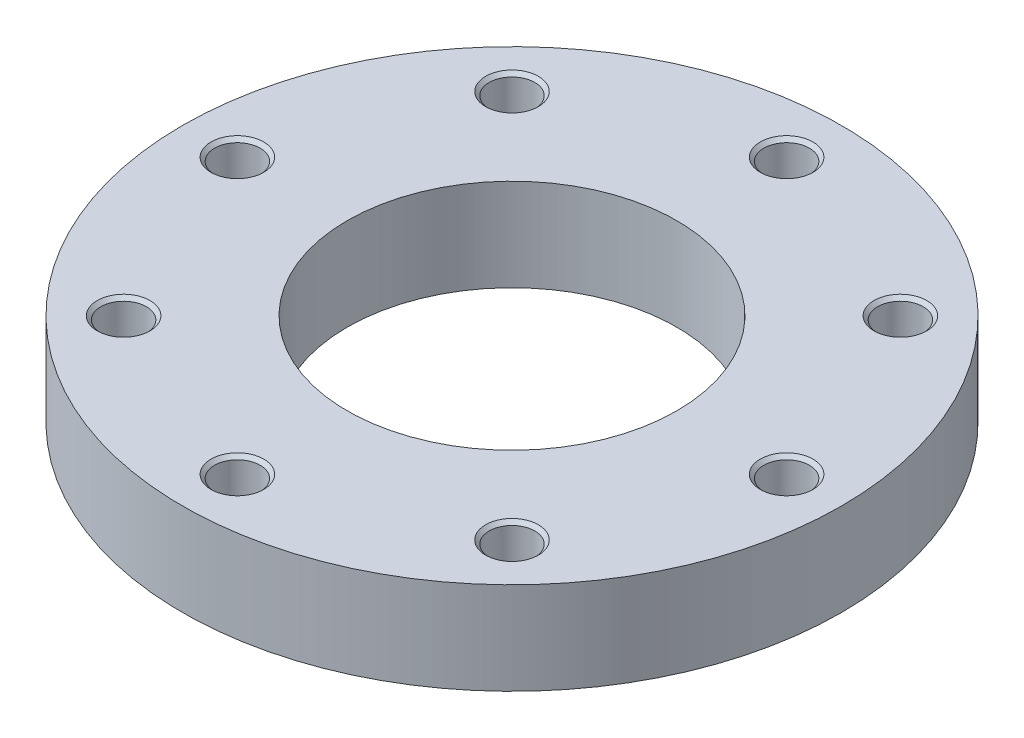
ISO-10303-21;
HEADER;
FILE_DESCRIPTION(('STEP AP214'),'2;1');
FILE_NAME('part.step','',(''),(''),'','','');
FILE_SCHEMA(('AUTOMOTIVE_DESIGN { 1 0 10303 214 1 1 1 1 }'));
ENDSEC;
DATA;
#1=APPLICATION_CONTEXT('core data for automotive mechanical design processes');
#2=APPLICATION_PROTOCOL_DEFINITION('international standard','automotive_design',2000,#1);
#3=PRODUCT_CONTEXT('',#1,'mechanical');
#4=PRODUCT('Part','Part','',(#3));
#5=PRODUCT_RELATED_PRODUCT_CATEGORY('part','',(#4));
#6=PRODUCT_DEFINITION_FORMATION('','',#4);
#7=PRODUCT_DEFINITION_CONTEXT('part definition',#1,'design');
#8=PRODUCT_DEFINITION('design','',#6,#7);
#9=PRODUCT_DEFINITION_SHAPE('','',#8);
#10=(LENGTH_UNIT() NAMED_UNIT(*) SI_UNIT(.MILLI.,.METRE.));
#11=(NAMED_UNIT(*) PLANE_ANGLE_UNIT() SI_UNIT($,.RADIAN.));
#12=(NAMED_UNIT(*) SI_UNIT($,.STERADIAN.) SOLID_ANGLE_UNIT());
#13=UNCERTAINTY_MEASURE_WITH_UNIT(LENGTH_MEASURE(1.E-05),#10,'distance_accuracy_value','');
#14=(GEOMETRIC_REPRESENTATION_CONTEXT(3) GLOBAL_UNCERTAINTY_ASSIGNED_CONTEXT((#13)) GLOBAL_UNIT_ASSIGNED_CONTEXT((#10,
#11,#12)) REPRESENTATION_CONTEXT('',''));
#15=CARTESIAN_POINT('',(0.,0.,0.));
#16=DIRECTION('',(0.,0.,1.));
#17=DIRECTION('',(1.,0.,0.));
#18=AXIS2_PLACEMENT_3D('',#15,#16,#17);
#19=CARTESIAN_POINT('',(0.,21.,0.));
#20=DIRECTION('',(0.,-1.,0.));
#21=DIRECTION('',(1.,0.,0.));
#22=AXIS2_PLACEMENT_3D('',#19,#20,#21);
#23=CYLINDRICAL_SURFACE('',#22,150.);
#24=CARTESIAN_POINT('',(0.,0.,0.));
#25=DIRECTION('',(0.,1.,0.));
#26=DIRECTION('',(1.,0.,0.));
#27=AXIS2_PLACEMENT_3D('',#24,#25,#26);
#28=CIRCLE('',#27,150.);
#29=CARTESIAN_POINT('',(150.,0.,0.));
#30=VERTEX_POINT('',#29);
#31=EDGE_CURVE('E9',#30,#30,#28,.T.);
#32=ORIENTED_EDGE('',*,*,#31,.T.);
#33=EDGE_LOOP('',(#32));
#34=FACE_BOUND('',#33,.T.);
#35=CARTESIAN_POINT('',(0.,42.,0.));
#36=DIRECTION('',(0.,1.,0.));
#37=DIRECTION('',(1.,0.,0.));
#38=AXIS2_PLACEMENT_3D('',#35,#36,#37);
#39=CIRCLE('',#38,150.);
#40=CARTESIAN_POINT('',(150.,42.,0.));
#41=VERTEX_POINT('',#40);
#42=EDGE_CURVE('E216',#41,#41,#39,.T.);
#43=ORIENTED_EDGE('',*,*,#42,.F.);
#44=EDGE_LOOP('',(#43));
#45=FACE_BOUND('',#44,.T.);
#46=ADVANCED_FACE('F15',(#34,#45),#23,.T.);
#47=CARTESIAN_POINT('',(112.5,0.,0.));
#48=DIRECTION('',(0.,-1.,0.));
#49=DIRECTION('',(-1.,0.,0.));
#50=AXIS2_PLACEMENT_3D('',#47,#48,#49);
#51=PLANE('',#50);
#52=CARTESIAN_POINT('',(0.,0.,0.));
#53=DIRECTION('',(0.,1.,0.));
#54=DIRECTION('',(1.,0.,0.));
#55=AXIS2_PLACEMENT_3D('',#52,#53,#54);
#56=CIRCLE('',#55,75.);
#57=CARTESIAN_POINT('',(75.,0.,0.));
#58=VERTEX_POINT('',#57);
#59=EDGE_CURVE('E18',#58,#58,#56,.T.);
#60=ORIENTED_EDGE('',*,*,#59,.T.);
#61=EDGE_LOOP('',(#60));
#62=FACE_BOUND('',#61,.T.);
#63=ORIENTED_EDGE('',*,*,#31,.F.);
#64=EDGE_LOOP('',(#63));
#65=FACE_BOUND('',#64,.T.);
#66=ADVANCED_FACE('F221',(#62,#65),#51,.T.);
#67=CARTESIAN_POINT('',(0.,21.,0.));
#68=DIRECTION('',(0.,-1.,0.));
#69=DIRECTION('',(1.,0.,0.));
#70=AXIS2_PLACEMENT_3D('',#67,#68,#69);
#71=CYLINDRICAL_SURFACE('',#70,75.);
#72=CARTESIAN_POINT('',(0.,42.,0.));
#73=DIRECTION('',(0.,1.,0.));
#74=DIRECTION('',(1.,0.,0.));
#75=AXIS2_PLACEMENT_3D('',#72,#73,#74);
#76=CIRCLE('',#75,75.);
#77=CARTESIAN_POINT('',(75.,42.,0.));
#78=VERTEX_POINT('',#77);
#79=EDGE_CURVE('E105',#78,#78,#76,.T.);
#80=ORIENTED_EDGE('',*,*,#79,.T.);
#81=EDGE_LOOP('',(#80));
#82=FACE_BOUND('',#81,.T.);
#83=ORIENTED_EDGE('',*,*,#59,.F.);
#84=EDGE_LOOP('',(#83));
#85=FACE_BOUND('',#84,.T.);
#86=ADVANCED_FACE('F224',(#82,#85),#71,.F.);
#87=CARTESIAN_POINT('',(112.5,42.,0.));
#88=DIRECTION('',(0.,1.,0.));
#89=DIRECTION('',(1.,0.,0.));
#90=AXIS2_PLACEMENT_3D('',#87,#88,#89);
#91=PLANE('',#90);
#92=ORIENTED_EDGE('',*,*,#42,.T.);
#93=EDGE_LOOP('',(#92));
#94=FACE_BOUND('',#93,.T.);
#95=ORIENTED_EDGE('',*,*,#79,.F.);
#96=EDGE_LOOP('',(#95));
#97=FACE_BOUND('',#96,.T.);
#98=CARTESIAN_POINT('',(125.,42.,0.));
#99=DIRECTION('',(0.,-1.,0.));
#100=DIRECTION('',(1.,0.,0.));
#101=AXIS2_PLACEMENT_3D('',#98,#99,#100);
#102=CIRCLE('',#101,12.);
#103=CARTESIAN_POINT('',(137.,42.,0.));
#104=VERTEX_POINT('',#103);
#105=EDGE_CURVE('E211',#104,#104,#102,.T.);
#106=ORIENTED_EDGE('',*,*,#105,.T.);
#107=EDGE_LOOP('',(#106));
#108=FACE_BOUND('',#107,.T.);
#109=CARTESIAN_POINT('',(88.3883476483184,42.,-88.3883476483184));
#110=DIRECTION('',(0.,-1.,0.));
#111=DIRECTION('',(0.707106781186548,0.,-0.707106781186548));
#112=AXIS2_PLACEMENT_3D('',#109,#110,#111);
#113=CIRCLE('',#112,12.);
#114=CARTESIAN_POINT('',(96.873629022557,42.,-96.873629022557));
#115=VERTEX_POINT('',#114);
#116=EDGE_CURVE('E197',#115,#115,#113,.T.);
#117=ORIENTED_EDGE('',*,*,#116,.T.);
#118=EDGE_LOOP('',(#117));
#119=FACE_BOUND('',#118,.T.);
#120=CARTESIAN_POINT('',(0.,42.,-125.));
#121=DIRECTION('',(0.,-1.,0.));
#122=DIRECTION('',(0.,0.,-1.));
#123=AXIS2_PLACEMENT_3D('',#120,#121,#122);
#124=CIRCLE('',#123,12.);
#125=CARTESIAN_POINT('',(0.,42.,-137.));
#126=VERTEX_POINT('',#125);
#127=EDGE_CURVE('E185',#126,#126,#124,.T.);
#128=ORIENTED_EDGE('',*,*,#127,.T.);
#129=EDGE_LOOP('',(#128));
#130=FACE_BOUND('',#129,.T.);
#131=CARTESIAN_POINT('',(-88.3883476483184,42.,-88.3883476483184));
#132=DIRECTION('',(0.,-1.,0.));
#133=DIRECTION('',(-0.707106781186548,0.,-0.707106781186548));
#134=AXIS2_PLACEMENT_3D('',#131,#132,#133);
#135=CIRCLE('',#134,12.);
#136=CARTESIAN_POINT('',(-96.873629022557,42.,-96.873629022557));
#137=VERTEX_POINT('',#136);
#138=EDGE_CURVE('E178',#137,#137,#135,.T.);
#139=ORIENTED_EDGE('',*,*,#138,.T.);
#140=EDGE_LOOP('',(#139));
#141=FACE_BOUND('',#140,.T.);
#142=CARTESIAN_POINT('',(-125.,42.,0.));
#143=DIRECTION('',(0.,-1.,0.));
#144=DIRECTION('',(-1.,0.,0.));
#145=AXIS2_PLACEMENT_3D('',#142,#143,#144);
#146=CIRCLE('',#145,12.);
#147=CARTESIAN_POINT('',(-137.,42.,0.));
#148=VERTEX_POINT('',#147);
#149=EDGE_CURVE('E758',#148,#148,#146,.T.);
#150=ORIENTED_EDGE('',*,*,#149,.T.);
#151=EDGE_LOOP('',(#150));
#152=FACE_BOUND('',#151,.T.);
#153=CARTESIAN_POINT('',(-88.3883476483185,42.,88.3883476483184));
#154=DIRECTION('',(0.,-1.,0.));
#155=DIRECTION('',(-0.707106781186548,0.,0.707106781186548));
#156=AXIS2_PLACEMENT_3D('',#153,#154,#155);
#157=CIRCLE('',#156,12.);
#158=CARTESIAN_POINT('',(-96.873629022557,42.,96.873629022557));
#159=VERTEX_POINT('',#158);
#160=EDGE_CURVE('E773',#159,#159,#157,.T.);
#161=ORIENTED_EDGE('',*,*,#160,.T.);
#162=EDGE_LOOP('',(#161));
#163=FACE_BOUND('',#162,.T.);
#164=CARTESIAN_POINT('',(0.,42.,125.));
#165=DIRECTION('',(0.,-1.,0.));
#166=DIRECTION('',(0.,0.,1.));
#167=AXIS2_PLACEMENT_3D('',#164,#165,#166);
#168=CIRCLE('',#167,12.);
#169=CARTESIAN_POINT('',(0.,42.,137.));
#170=VERTEX_POINT('',#169);
#171=EDGE_CURVE('E765',#170,#170,#168,.T.);
#172=ORIENTED_EDGE('',*,*,#171,.T.);
#173=EDGE_LOOP('',(#172));
#174=FACE_BOUND('',#173,.T.);
#175=CARTESIAN_POINT('',(88.3883476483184,42.,88.3883476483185));
#176=DIRECTION('',(0.,-1.,0.));
#177=DIRECTION('',(0.707106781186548,0.,0.707106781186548));
#178=AXIS2_PLACEMENT_3D('',#175,#176,#177);
#179=CIRCLE('',#178,12.);
#180=CARTESIAN_POINT('',(96.873629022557,42.,96.873629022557));
#181=VERTEX_POINT('',#180);
#182=EDGE_CURVE('E745',#181,#181,#179,.T.);
#183=ORIENTED_EDGE('',*,*,#182,.T.);
#184=EDGE_LOOP('',(#183));
#185=FACE_BOUND('',#184,.T.);
#186=ADVANCED_FACE('F226',(#94,#97,#108,#119,#130,#141,#152,#163,#174,#185),#91,.T.);
#187=CARTESIAN_POINT('',(125.,6.00463463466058,0.));
#188=DIRECTION('',(0.,1.,0.));
#189=DIRECTION('',(1.,0.,0.));
#190=AXIS2_PLACEMENT_3D('',#187,#188,#189);
#191=CONICAL_SURFACE('',#190,5.188125,1.0471975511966);
#192=CARTESIAN_POINT('',(125.,9.,0.));
#193=DIRECTION('',(0.,-1.,0.));
#194=DIRECTION('',(1.,0.,0.));
#195=AXIS2_PLACEMENT_3D('',#192,#193,#194);
#196=CIRCLE('',#195,10.37625);
#197=CARTESIAN_POINT('',(135.37625,9.,0.));
#198=VERTEX_POINT('',#197);
#199=EDGE_CURVE('E100',#198,#198,#196,.T.);
#200=ORIENTED_EDGE('',*,*,#199,.F.);
#201=EDGE_LOOP('',(#200));
#202=FACE_BOUND('',#201,.T.);
#203=CARTESIAN_POINT('',(125.,3.00926926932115,0.));
#204=VERTEX_POINT('',#203);
#205=VERTEX_LOOP('',#204);
#206=FACE_BOUND('',#205,.T.);
#207=ADVANCED_FACE('F233',(#202,#206),#191,.F.);
#208=CARTESIAN_POINT('',(125.,12.688125,0.));
#209=DIRECTION('',(0.,1.,0.));
#210=DIRECTION('',(1.,0.,0.));
#211=AXIS2_PLACEMENT_3D('',#208,#209,#210);
#212=CYLINDRICAL_SURFACE('',#211,10.37625);
#213=CARTESIAN_POINT('',(125.,16.37625,0.));
#214=DIRECTION('',(0.,-1.,0.));
#215=DIRECTION('',(1.,0.,0.));
#216=AXIS2_PLACEMENT_3D('',#213,#214,#215);
#217=CIRCLE('',#216,10.37625);
#218=CARTESIAN_POINT('',(135.37625,16.37625,0.));
#219=VERTEX_POINT('',#218);
#220=EDGE_CURVE('E95',#219,#219,#217,.T.);
#221=ORIENTED_EDGE('',*,*,#220,.F.);
#222=EDGE_LOOP('',(#221));
#223=FACE_BOUND('',#222,.T.);
#224=ORIENTED_EDGE('',*,*,#199,.T.);
#225=EDGE_LOOP('',(#224));
#226=FACE_BOUND('',#225,.T.);
#227=ADVANCED_FACE('F269',(#223,#226),#212,.F.);
#228=CARTESIAN_POINT('',(125.,17.188125,0.));
#229=DIRECTION('',(0.,1.,0.));
#230=DIRECTION('',(1.,0.,0.));
#231=AXIS2_PLACEMENT_3D('',#228,#229,#230);
#232=CONICAL_SURFACE('',#231,11.188125,0.785398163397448);
#233=CARTESIAN_POINT('',(125.,18.,0.));
#234=DIRECTION('',(0.,-1.,0.));
#235=DIRECTION('',(1.,0.,0.));
#236=AXIS2_PLACEMENT_3D('',#233,#234,#235);
#237=CIRCLE('',#236,12.);
#238=CARTESIAN_POINT('',(137.,18.,0.));
#239=VERTEX_POINT('',#238);
#240=EDGE_CURVE('E214',#239,#239,#237,.T.);
#241=ORIENTED_EDGE('',*,*,#240,.F.);
#242=EDGE_LOOP('',(#241));
#243=FACE_BOUND('',#242,.T.);
#244=ORIENTED_EDGE('',*,*,#220,.T.);
#245=EDGE_LOOP('',(#244));
#246=FACE_BOUND('',#245,.T.);
#247=ADVANCED_FACE('F279',(#243,#246),#232,.F.);
#248=CARTESIAN_POINT('',(136.188125,18.,0.));
#249=DIRECTION('',(0.,1.,0.));
#250=DIRECTION('',(-1.,0.,0.));
#251=AXIS2_PLACEMENT_3D('',#248,#249,#250);
#252=PLANE('',#251);
#253=CARTESIAN_POINT('',(125.,18.,0.));
#254=DIRECTION('',(0.,-1.,0.));
#255=DIRECTION('',(1.,0.,0.));
#256=AXIS2_PLACEMENT_3D('',#253,#254,#255);
#257=CIRCLE('',#256,10.37625);
#258=CARTESIAN_POINT('',(135.37625,18.,0.));
#259=VERTEX_POINT('',#258);
#260=EDGE_CURVE('E212',#259,#259,#257,.T.);
#261=ORIENTED_EDGE('',*,*,#260,.F.);
#262=EDGE_LOOP('',(#261));
#263=FACE_BOUND('',#262,.T.);
#264=ORIENTED_EDGE('',*,*,#240,.T.);
#265=EDGE_LOOP('',(#264));
#266=FACE_BOUND('',#265,.T.);
#267=ADVANCED_FACE('F289',(#263,#266),#252,.F.);
#268=CARTESIAN_POINT('',(125.,29.188125,0.));
#269=DIRECTION('',(0.,1.,0.));
#270=DIRECTION('',(1.,0.,0.));
#271=AXIS2_PLACEMENT_3D('',#268,#269,#270);
#272=CYLINDRICAL_SURFACE('',#271,10.37625);
#273=CARTESIAN_POINT('',(125.,40.37625,0.));
#274=DIRECTION('',(0.,-1.,0.));
#275=DIRECTION('',(1.,0.,0.));
#276=AXIS2_PLACEMENT_3D('',#273,#274,#275);
#277=CIRCLE('',#276,10.37625);
#278=CARTESIAN_POINT('',(135.37625,40.37625,0.));
#279=VERTEX_POINT('',#278);
#280=EDGE_CURVE('E209',#279,#279,#277,.T.);
#281=ORIENTED_EDGE('',*,*,#280,.F.);
#282=EDGE_LOOP('',(#281));
#283=FACE_BOUND('',#282,.T.);
#284=ORIENTED_EDGE('',*,*,#260,.T.);
#285=EDGE_LOOP('',(#284));
#286=FACE_BOUND('',#285,.T.);
#287=ADVANCED_FACE('F299',(#283,#286),#272,.F.);
#288=CARTESIAN_POINT('',(125.,41.188125,0.));
#289=DIRECTION('',(0.,1.,0.));
#290=DIRECTION('',(1.,0.,0.));
#291=AXIS2_PLACEMENT_3D('',#288,#289,#290);
#292=CONICAL_SURFACE('',#291,11.188125,0.785398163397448);
#293=ORIENTED_EDGE('',*,*,#105,.F.);
#294=EDGE_LOOP('',(#293));
#295=FACE_BOUND('',#294,.T.);
#296=ORIENTED_EDGE('',*,*,#280,.T.);
#297=EDGE_LOOP('',(#296));
#298=FACE_BOUND('',#297,.T.);
#299=ADVANCED_FACE('F309',(#295,#298),#292,.F.);
#300=CARTESIAN_POINT('',(88.3883476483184,6.00463463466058,-88.3883476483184));
#301=DIRECTION('',(0.,1.,0.));
#302=DIRECTION('',(0.707106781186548,0.,-0.707106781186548));
#303=AXIS2_PLACEMENT_3D('',#300,#301,#302);
#304=CONICAL_SURFACE('',#303,5.188125,1.0471975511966);
#305=CARTESIAN_POINT('',(88.3883476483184,9.,-88.3883476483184));
#306=DIRECTION('',(0.,-1.,0.));
#307=DIRECTION('',(0.707106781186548,0.,-0.707106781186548));
#308=AXIS2_PLACEMENT_3D('',#305,#306,#307);
#309=CIRCLE('',#308,10.37625);
#310=CARTESIAN_POINT('',(95.7254643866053,9.,-95.7254643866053));
#311=VERTEX_POINT('',#310);
#312=EDGE_CURVE('E207',#311,#311,#309,.T.);
#313=ORIENTED_EDGE('',*,*,#312,.F.);
#314=EDGE_LOOP('',(#313));
#315=FACE_BOUND('',#314,.T.);
#316=CARTESIAN_POINT('',(88.3883476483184,3.00926926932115,-88.3883476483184));
#317=VERTEX_POINT('',#316);
#318=VERTEX_LOOP('',#317);
#319=FACE_BOUND('',#318,.T.);
#320=ADVANCED_FACE('F319',(#315,#319),#304,.F.);
#321=CARTESIAN_POINT('',(88.3883476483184,12.688125,-88.3883476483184));
#322=DIRECTION('',(0.,1.,0.));
#323=DIRECTION('',(0.707106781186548,0.,-0.707106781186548));
#324=AXIS2_PLACEMENT_3D('',#321,#322,#323);
#325=CYLINDRICAL_SURFACE('',#324,10.37625);
#326=CARTESIAN_POINT('',(88.3883476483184,16.37625,-88.3883476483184));
#327=DIRECTION('',(0.,-1.,0.));
#328=DIRECTION('',(0.707106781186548,0.,-0.707106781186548));
#329=AXIS2_PLACEMENT_3D('',#326,#327,#328);
#330=CIRCLE('',#329,10.37625);
#331=CARTESIAN_POINT('',(95.7254643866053,16.37625,-95.7254643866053));
#332=VERTEX_POINT('',#331);
#333=EDGE_CURVE('E204',#332,#332,#330,.T.);
#334=ORIENTED_EDGE('',*,*,#333,.F.);
#335=EDGE_LOOP('',(#334));
#336=FACE_BOUND('',#335,.T.);
#337=ORIENTED_EDGE('',*,*,#312,.T.);
#338=EDGE_LOOP('',(#337));
#339=FACE_BOUND('',#338,.T.);
#340=ADVANCED_FACE('F329',(#336,#339),#325,.F.);
#341=CARTESIAN_POINT('',(88.3883476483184,17.188125,-88.3883476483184));
#342=DIRECTION('',(0.,1.,0.));
#343=DIRECTION('',(0.707106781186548,0.,-0.707106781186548));
#344=AXIS2_PLACEMENT_3D('',#341,#342,#343);
#345=CONICAL_SURFACE('',#344,11.188125,0.785398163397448);
#346=CARTESIAN_POINT('',(88.3883476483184,18.,-88.3883476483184));
#347=DIRECTION('',(0.,-1.,0.));
#348=DIRECTION('',(0.707106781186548,0.,-0.707106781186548));
#349=AXIS2_PLACEMENT_3D('',#346,#347,#348);
#350=CIRCLE('',#349,12.);
#351=CARTESIAN_POINT('',(96.873629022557,18.,-96.873629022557));
#352=VERTEX_POINT('',#351);
#353=EDGE_CURVE('E201',#352,#352,#350,.T.);
#354=ORIENTED_EDGE('',*,*,#353,.F.);
#355=EDGE_LOOP('',(#354));
#356=FACE_BOUND('',#355,.T.);
#357=ORIENTED_EDGE('',*,*,#333,.T.);
#358=EDGE_LOOP('',(#357));
#359=FACE_BOUND('',#358,.T.);
#360=ADVANCED_FACE('F339',(#356,#359),#345,.F.);
#361=CARTESIAN_POINT('',(96.2995467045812,18.,-96.2995467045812));
#362=DIRECTION('',(0.,1.,0.));
#363=DIRECTION('',(-0.707106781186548,0.,0.707106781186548));
#364=AXIS2_PLACEMENT_3D('',#361,#362,#363);
#365=PLANE('',#364);
#366=CARTESIAN_POINT('',(88.3883476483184,18.,-88.3883476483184));
#367=DIRECTION('',(0.,-1.,0.));
#368=DIRECTION('',(0.707106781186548,0.,-0.707106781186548));
#369=AXIS2_PLACEMENT_3D('',#366,#367,#368);
#370=CIRCLE('',#369,10.37625);
#371=CARTESIAN_POINT('',(95.7254643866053,18.,-95.7254643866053));
#372=VERTEX_POINT('',#371);
#373=EDGE_CURVE('E199',#372,#372,#370,.T.);
#374=ORIENTED_EDGE('',*,*,#373,.F.);
#375=EDGE_LOOP('',(#374));
#376=FACE_BOUND('',#375,.T.);
#377=ORIENTED_EDGE('',*,*,#353,.T.);
#378=EDGE_LOOP('',(#377));
#379=FACE_BOUND('',#378,.T.);
#380=ADVANCED_FACE('F349',(#376,#379),#365,.F.);
#381=CARTESIAN_POINT('',(88.3883476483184,29.188125,-88.3883476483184));
#382=DIRECTION('',(0.,1.,0.));
#383=DIRECTION('',(0.707106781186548,0.,-0.707106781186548));
#384=AXIS2_PLACEMENT_3D('',#381,#382,#383);
#385=CYLINDRICAL_SURFACE('',#384,10.37625);
#386=CARTESIAN_POINT('',(88.3883476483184,40.37625,-88.3883476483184));
#387=DIRECTION('',(0.,-1.,0.));
#388=DIRECTION('',(0.707106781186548,0.,-0.707106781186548));
#389=AXIS2_PLACEMENT_3D('',#386,#387,#388);
#390=CIRCLE('',#389,10.37625);
#391=CARTESIAN_POINT('',(95.7254643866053,40.37625,-95.7254643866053));
#392=VERTEX_POINT('',#391);
#393=EDGE_CURVE('E195',#392,#392,#390,.T.);
#394=ORIENTED_EDGE('',*,*,#393,.F.);
#395=EDGE_LOOP('',(#394));
#396=FACE_BOUND('',#395,.T.);
#397=ORIENTED_EDGE('',*,*,#373,.T.);
#398=EDGE_LOOP('',(#397));
#399=FACE_BOUND('',#398,.T.);
#400=ADVANCED_FACE('F359',(#396,#399),#385,.F.);
#401=CARTESIAN_POINT('',(88.3883476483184,41.188125,-88.3883476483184));
#402=DIRECTION('',(0.,1.,0.));
#403=DIRECTION('',(0.707106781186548,0.,-0.707106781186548));
#404=AXIS2_PLACEMENT_3D('',#401,#402,#403);
#405=CONICAL_SURFACE('',#404,11.188125,0.785398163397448);
#406=ORIENTED_EDGE('',*,*,#116,.F.);
#407=EDGE_LOOP('',(#406));
#408=FACE_BOUND('',#407,.T.);
#409=ORIENTED_EDGE('',*,*,#393,.T.);
#410=EDGE_LOOP('',(#409));
#411=FACE_BOUND('',#410,.T.);
#412=ADVANCED_FACE('F369',(#408,#411),#405,.F.);
#413=CARTESIAN_POINT('',(0.,6.00463463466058,-125.));
#414=DIRECTION('',(0.,1.,0.));
#415=DIRECTION('',(0.,0.,-1.));
#416=AXIS2_PLACEMENT_3D('',#413,#414,#415);
#417=CONICAL_SURFACE('',#416,5.188125,1.0471975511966);
#418=CARTESIAN_POINT('',(0.,9.,-125.));
#419=DIRECTION('',(0.,-1.,0.));
#420=DIRECTION('',(0.,0.,-1.));
#421=AXIS2_PLACEMENT_3D('',#418,#419,#420);
#422=CIRCLE('',#421,10.37625);
#423=CARTESIAN_POINT('',(0.,9.,-135.37625));
#424=VERTEX_POINT('',#423);
#425=EDGE_CURVE('E193',#424,#424,#422,.T.);
#426=ORIENTED_EDGE('',*,*,#425,.F.);
#427=EDGE_LOOP('',(#426));
#428=FACE_BOUND('',#427,.T.);
#429=CARTESIAN_POINT('',(0.,3.00926926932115,-125.));
#430=VERTEX_POINT('',#429);
#431=VERTEX_LOOP('',#430);
#432=FACE_BOUND('',#431,.T.);
#433=ADVANCED_FACE('F379',(#428,#432),#417,.F.);
#434=CARTESIAN_POINT('',(0.,12.688125,-125.));
#435=DIRECTION('',(0.,1.,0.));
#436=DIRECTION('',(0.,0.,-1.));
#437=AXIS2_PLACEMENT_3D('',#434,#435,#436);
#438=CYLINDRICAL_SURFACE('',#437,10.37625);
#439=CARTESIAN_POINT('',(0.,16.37625,-125.));
#440=DIRECTION('',(0.,-1.,0.));
#441=DIRECTION('',(0.,0.,-1.));
#442=AXIS2_PLACEMENT_3D('',#439,#440,#441);
#443=CIRCLE('',#442,10.37625);
#444=CARTESIAN_POINT('',(0.,16.37625,-135.37625));
#445=VERTEX_POINT('',#444);
#446=EDGE_CURVE('E191',#445,#445,#443,.T.);
#447=ORIENTED_EDGE('',*,*,#446,.F.);
#448=EDGE_LOOP('',(#447));
#449=FACE_BOUND('',#448,.T.);
#450=ORIENTED_EDGE('',*,*,#425,.T.);
#451=EDGE_LOOP('',(#450));
#452=FACE_BOUND('',#451,.T.);
#453=ADVANCED_FACE('F389',(#449,#452),#438,.F.);
#454=CARTESIAN_POINT('',(0.,17.188125,-125.));
#455=DIRECTION('',(0.,1.,0.));
#456=DIRECTION('',(0.,0.,-1.));
#457=AXIS2_PLACEMENT_3D('',#454,#455,#456);
#458=CONICAL_SURFACE('',#457,11.188125,0.785398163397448);
#459=CARTESIAN_POINT('',(0.,18.,-125.));
#460=DIRECTION('',(0.,-1.,0.));
#461=DIRECTION('',(0.,0.,-1.));
#462=AXIS2_PLACEMENT_3D('',#459,#460,#461);
#463=CIRCLE('',#462,12.);
#464=CARTESIAN_POINT('',(0.,18.,-137.));
#465=VERTEX_POINT('',#464);
#466=EDGE_CURVE('E189',#465,#465,#463,.T.);
#467=ORIENTED_EDGE('',*,*,#466,.F.);
#468=EDGE_LOOP('',(#467));
#469=FACE_BOUND('',#468,.T.);
#470=ORIENTED_EDGE('',*,*,#446,.T.);
#471=EDGE_LOOP('',(#470));
#472=FACE_BOUND('',#471,.T.);
#473=ADVANCED_FACE('F399',(#469,#472),#458,.F.);
#474=CARTESIAN_POINT('',(0.,18.,-136.188125));
#475=DIRECTION('',(0.,1.,0.));
#476=DIRECTION('',(0.,0.,1.));
#477=AXIS2_PLACEMENT_3D('',#474,#475,#476);
#478=PLANE('',#477);
#479=CARTESIAN_POINT('',(0.,18.,-125.));
#480=DIRECTION('',(0.,-1.,0.));
#481=DIRECTION('',(0.,0.,-1.));
#482=AXIS2_PLACEMENT_3D('',#479,#480,#481);
#483=CIRCLE('',#482,10.37625);
#484=CARTESIAN_POINT('',(0.,18.,-135.37625));
#485=VERTEX_POINT('',#484);
#486=EDGE_CURVE('E187',#485,#485,#483,.T.);
#487=ORIENTED_EDGE('',*,*,#486,.F.);
#488=EDGE_LOOP('',(#487));
#489=FACE_BOUND('',#488,.T.);
#490=ORIENTED_EDGE('',*,*,#466,.T.);
#491=EDGE_LOOP('',(#490));
#492=FACE_BOUND('',#491,.T.);
#493=ADVANCED_FACE('F409',(#489,#492),#478,.F.);
#494=CARTESIAN_POINT('',(0.,29.188125,-125.));
#495=DIRECTION('',(0.,1.,0.));
#496=DIRECTION('',(0.,0.,-1.));
#497=AXIS2_PLACEMENT_3D('',#494,#495,#496);
#498=CYLINDRICAL_SURFACE('',#497,10.37625);
#499=CARTESIAN_POINT('',(0.,40.37625,-125.));
#500=DIRECTION('',(0.,-1.,0.));
#501=DIRECTION('',(0.,0.,-1.));
#502=AXIS2_PLACEMENT_3D('',#499,#500,#501);
#503=CIRCLE('',#502,10.37625);
#504=CARTESIAN_POINT('',(0.,40.37625,-135.37625));
#505=VERTEX_POINT('',#504);
#506=EDGE_CURVE('E183',#505,#505,#503,.T.);
#507=ORIENTED_EDGE('',*,*,#506,.F.);
#508=EDGE_LOOP('',(#507));
#509=FACE_BOUND('',#508,.T.);
#510=ORIENTED_EDGE('',*,*,#486,.T.);
#511=EDGE_LOOP('',(#510));
#512=FACE_BOUND('',#511,.T.);
#513=ADVANCED_FACE('F419',(#509,#512),#498,.F.);
#514=CARTESIAN_POINT('',(0.,41.188125,-125.));
#515=DIRECTION('',(0.,1.,0.));
#516=DIRECTION('',(0.,0.,-1.));
#517=AXIS2_PLACEMENT_3D('',#514,#515,#516);
#518=CONICAL_SURFACE('',#517,11.188125,0.785398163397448);
#519=ORIENTED_EDGE('',*,*,#127,.F.);
#520=EDGE_LOOP('',(#519));
#521=FACE_BOUND('',#520,.T.);
#522=ORIENTED_EDGE('',*,*,#506,.T.);
#523=EDGE_LOOP('',(#522));
#524=FACE_BOUND('',#523,.T.);
#525=ADVANCED_FACE('F429',(#521,#524),#518,.F.);
#526=CARTESIAN_POINT('',(-88.3883476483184,6.00463463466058,-88.3883476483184));
#527=DIRECTION('',(0.,1.,0.));
#528=DIRECTION('',(-0.707106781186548,0.,-0.707106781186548));
#529=AXIS2_PLACEMENT_3D('',#526,#527,#528);
#530=CONICAL_SURFACE('',#529,5.188125,1.0471975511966);
#531=CARTESIAN_POINT('',(-88.3883476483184,9.,-88.3883476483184));
#532=DIRECTION('',(0.,-1.,0.));
#533=DIRECTION('',(-0.707106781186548,0.,-0.707106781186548));
#534=AXIS2_PLACEMENT_3D('',#531,#532,#533);
#535=CIRCLE('',#534,10.37625);
#536=CARTESIAN_POINT('',(-95.7254643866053,9.,-95.7254643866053));
#537=VERTEX_POINT('',#536);
#538=EDGE_CURVE('E176',#537,#537,#535,.T.);
#539=ORIENTED_EDGE('',*,*,#538,.F.);
#540=EDGE_LOOP('',(#539));
#541=FACE_BOUND('',#540,.T.);
#542=CARTESIAN_POINT('',(-88.3883476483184,3.00926926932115,-88.3883476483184));
#543=VERTEX_POINT('',#542);
#544=VERTEX_LOOP('',#543);
#545=FACE_BOUND('',#544,.T.);
#546=ADVANCED_FACE('F439',(#541,#545),#530,.F.);
#547=CARTESIAN_POINT('',(-88.3883476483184,12.688125,-88.3883476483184));
#548=DIRECTION('',(0.,1.,0.));
#549=DIRECTION('',(-0.707106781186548,0.,-0.707106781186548));
#550=AXIS2_PLACEMENT_3D('',#547,#548,#549);
#551=CYLINDRICAL_SURFACE('',#550,10.37625);
#552=CARTESIAN_POINT('',(-88.3883476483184,16.37625,-88.3883476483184));
#553=DIRECTION('',(0.,-1.,0.));
#554=DIRECTION('',(-0.707106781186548,0.,-0.707106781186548));
#555=AXIS2_PLACEMENT_3D('',#552,#553,#554);
#556=CIRCLE('',#555,10.37625);
#557=CARTESIAN_POINT('',(-95.7254643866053,16.37625,-95.7254643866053));
#558=VERTEX_POINT('',#557);
#559=EDGE_CURVE('E174',#558,#558,#556,.T.);
#560=ORIENTED_EDGE('',*,*,#559,.F.);
#561=EDGE_LOOP('',(#560));
#562=FACE_BOUND('',#561,.T.);
#563=ORIENTED_EDGE('',*,*,#538,.T.);
#564=EDGE_LOOP('',(#563));
#565=FACE_BOUND('',#564,.T.);
#566=ADVANCED_FACE('F449',(#562,#565),#551,.F.);
#567=CARTESIAN_POINT('',(-88.3883476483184,17.188125,-88.3883476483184));
#568=DIRECTION('',(0.,1.,0.));
#569=DIRECTION('',(-0.707106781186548,0.,-0.707106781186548));
#570=AXIS2_PLACEMENT_3D('',#567,#568,#569);
#571=CONICAL_SURFACE('',#570,11.188125,0.785398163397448);
#572=CARTESIAN_POINT('',(-88.3883476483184,18.,-88.3883476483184));
#573=DIRECTION('',(0.,-1.,0.));
#574=DIRECTION('',(-0.707106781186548,0.,-0.707106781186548));
#575=AXIS2_PLACEMENT_3D('',#572,#573,#574);
#576=CIRCLE('',#575,12.);
#577=CARTESIAN_POINT('',(-96.873629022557,18.,-96.873629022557));
#578=VERTEX_POINT('',#577);
#579=EDGE_CURVE('E171',#578,#578,#576,.T.);
#580=ORIENTED_EDGE('',*,*,#579,.F.);
#581=EDGE_LOOP('',(#580));
#582=FACE_BOUND('',#581,.T.);
#583=ORIENTED_EDGE('',*,*,#559,.T.);
#584=EDGE_LOOP('',(#583));
#585=FACE_BOUND('',#584,.T.);
#586=ADVANCED_FACE('F459',(#582,#585),#571,.F.);
#587=CARTESIAN_POINT('',(-96.2995467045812,18.,-96.2995467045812));
#588=DIRECTION('',(0.,1.,0.));
#589=DIRECTION('',(0.707106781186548,0.,0.707106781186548));
#590=AXIS2_PLACEMENT_3D('',#587,#588,#589);
#591=PLANE('',#590);
#592=CARTESIAN_POINT('',(-88.3883476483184,18.,-88.3883476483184));
#593=DIRECTION('',(0.,-1.,0.));
#594=DIRECTION('',(-0.707106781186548,0.,-0.707106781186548));
#595=AXIS2_PLACEMENT_3D('',#592,#593,#594);
#596=CIRCLE('',#595,10.37625);
#597=CARTESIAN_POINT('',(-95.7254643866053,18.,-95.7254643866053));
#598=VERTEX_POINT('',#597);
#599=EDGE_CURVE('E167',#598,#598,#596,.T.);
#600=ORIENTED_EDGE('',*,*,#599,.F.);
#601=EDGE_LOOP('',(#600));
#602=FACE_BOUND('',#601,.T.);
#603=ORIENTED_EDGE('',*,*,#579,.T.);
#604=EDGE_LOOP('',(#603));
#605=FACE_BOUND('',#604,.T.);
#606=ADVANCED_FACE('F172',(#602,#605),#591,.F.);
#607=CARTESIAN_POINT('',(-88.3883476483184,29.188125,-88.3883476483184));
#608=DIRECTION('',(0.,1.,0.));
#609=DIRECTION('',(-0.707106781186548,0.,-0.707106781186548));
#610=AXIS2_PLACEMENT_3D('',#607,#608,#609);
#611=CYLINDRICAL_SURFACE('',#610,10.37625);
#612=CARTESIAN_POINT('',(-88.3883476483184,40.37625,-88.3883476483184));
#613=DIRECTION('',(0.,-1.,0.));
#614=DIRECTION('',(-0.707106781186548,0.,-0.707106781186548));
#615=AXIS2_PLACEMENT_3D('',#612,#613,#614);
#616=CIRCLE('',#615,10.37625);
#617=CARTESIAN_POINT('',(-95.7254643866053,40.37625,-95.7254643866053));
#618=VERTEX_POINT('',#617);
#619=EDGE_CURVE('E811',#618,#618,#616,.T.);
#620=ORIENTED_EDGE('',*,*,#619,.F.);
#621=EDGE_LOOP('',(#620));
#622=FACE_BOUND('',#621,.T.);
#623=ORIENTED_EDGE('',*,*,#599,.T.);
#624=EDGE_LOOP('',(#623));
#625=FACE_BOUND('',#624,.T.);
#626=ADVANCED_FACE('F477',(#622,#625),#611,.F.);
#627=CARTESIAN_POINT('',(-88.3883476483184,41.188125,-88.3883476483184));
#628=DIRECTION('',(0.,1.,0.));
#629=DIRECTION('',(-0.707106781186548,0.,-0.707106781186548));
#630=AXIS2_PLACEMENT_3D('',#627,#628,#629);
#631=CONICAL_SURFACE('',#630,11.188125,0.785398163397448);
#632=ORIENTED_EDGE('',*,*,#138,.F.);
#633=EDGE_LOOP('',(#632));
#634=FACE_BOUND('',#633,.T.);
#635=ORIENTED_EDGE('',*,*,#619,.T.);
#636=EDGE_LOOP('',(#635));
#637=FACE_BOUND('',#636,.T.);
#638=ADVANCED_FACE('F487',(#634,#637),#631,.F.);
#639=CARTESIAN_POINT('',(-125.,6.00463463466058,0.));
#640=DIRECTION('',(0.,1.,0.));
#641=DIRECTION('',(-1.,0.,0.));
#642=AXIS2_PLACEMENT_3D('',#639,#640,#641);
#643=CONICAL_SURFACE('',#642,5.188125,1.0471975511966);
#644=CARTESIAN_POINT('',(-125.,9.,0.));
#645=DIRECTION('',(0.,-1.,0.));
#646=DIRECTION('',(-1.,0.,0.));
#647=AXIS2_PLACEMENT_3D('',#644,#645,#646);
#648=CIRCLE('',#647,10.37625);
#649=CARTESIAN_POINT('',(-135.37625,9.,0.));
#650=VERTEX_POINT('',#649);
#651=EDGE_CURVE('E808',#650,#650,#648,.T.);
#652=ORIENTED_EDGE('',*,*,#651,.F.);
#653=EDGE_LOOP('',(#652));
#654=FACE_BOUND('',#653,.T.);
#655=CARTESIAN_POINT('',(-125.,3.00926926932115,0.));
#656=VERTEX_POINT('',#655);
#657=VERTEX_LOOP('',#656);
#658=FACE_BOUND('',#657,.T.);
#659=ADVANCED_FACE('F497',(#654,#658),#643,.F.);
#660=CARTESIAN_POINT('',(-125.,12.688125,0.));
#661=DIRECTION('',(0.,1.,0.));
#662=DIRECTION('',(-1.,0.,0.));
#663=AXIS2_PLACEMENT_3D('',#660,#661,#662);
#664=CYLINDRICAL_SURFACE('',#663,10.37625);
#665=CARTESIAN_POINT('',(-125.,16.37625,0.));
#666=DIRECTION('',(0.,-1.,0.));
#667=DIRECTION('',(-1.,0.,0.));
#668=AXIS2_PLACEMENT_3D('',#665,#666,#667);
#669=CIRCLE('',#668,10.37625);
#670=CARTESIAN_POINT('',(-135.37625,16.37625,0.));
#671=VERTEX_POINT('',#670);
#672=EDGE_CURVE('E807',#671,#671,#669,.T.);
#673=ORIENTED_EDGE('',*,*,#672,.F.);
#674=EDGE_LOOP('',(#673));
#675=FACE_BOUND('',#674,.T.);
#676=ORIENTED_EDGE('',*,*,#651,.T.);
#677=EDGE_LOOP('',(#676));
#678=FACE_BOUND('',#677,.T.);
#679=ADVANCED_FACE('F507',(#675,#678),#664,.F.);
#680=CARTESIAN_POINT('',(-125.,17.188125,0.));
#681=DIRECTION('',(0.,1.,0.));
#682=DIRECTION('',(-1.,0.,0.));
#683=AXIS2_PLACEMENT_3D('',#680,#681,#682);
#684=CONICAL_SURFACE('',#683,11.188125,0.785398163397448);
#685=CARTESIAN_POINT('',(-125.,18.,0.));
#686=DIRECTION('',(0.,-1.,0.));
#687=DIRECTION('',(-1.,0.,0.));
#688=AXIS2_PLACEMENT_3D('',#685,#686,#687);
#689=CIRCLE('',#688,12.);
#690=CARTESIAN_POINT('',(-137.,18.,0.));
#691=VERTEX_POINT('',#690);
#692=EDGE_CURVE('E757',#691,#691,#689,.T.);
#693=ORIENTED_EDGE('',*,*,#692,.F.);
#694=EDGE_LOOP('',(#693));
#695=FACE_BOUND('',#694,.T.);
#696=ORIENTED_EDGE('',*,*,#672,.T.);
#697=EDGE_LOOP('',(#696));
#698=FACE_BOUND('',#697,.T.);
#699=ADVANCED_FACE('F517',(#695,#698),#684,.F.);
#700=CARTESIAN_POINT('',(-136.188125,18.,0.));
#701=DIRECTION('',(0.,1.,0.));
#702=DIRECTION('',(1.,0.,0.));
#703=AXIS2_PLACEMENT_3D('',#700,#701,#702);
#704=PLANE('',#703);
#705=CARTESIAN_POINT('',(-125.,18.,0.));
#706=DIRECTION('',(0.,-1.,0.));
#707=DIRECTION('',(-1.,0.,0.));
#708=AXIS2_PLACEMENT_3D('',#705,#706,#707);
#709=CIRCLE('',#708,10.37625);
#710=CARTESIAN_POINT('',(-135.37625,18.,0.));
#711=VERTEX_POINT('',#710);
#712=EDGE_CURVE('E756',#711,#711,#709,.T.);
#713=ORIENTED_EDGE('',*,*,#712,.F.);
#714=EDGE_LOOP('',(#713));
#715=FACE_BOUND('',#714,.T.);
#716=ORIENTED_EDGE('',*,*,#692,.T.);
#717=EDGE_LOOP('',(#716));
#718=FACE_BOUND('',#717,.T.);
#719=ADVANCED_FACE('F527',(#715,#718),#704,.F.);
#720=CARTESIAN_POINT('',(-125.,29.188125,0.));
#721=DIRECTION('',(0.,1.,0.));
#722=DIRECTION('',(-1.,0.,0.));
#723=AXIS2_PLACEMENT_3D('',#720,#721,#722);
#724=CYLINDRICAL_SURFACE('',#723,10.37625);
#725=CARTESIAN_POINT('',(-125.,40.37625,0.));
#726=DIRECTION('',(0.,-1.,0.));
#727=DIRECTION('',(-1.,0.,0.));
#728=AXIS2_PLACEMENT_3D('',#725,#726,#727);
#729=CIRCLE('',#728,10.37625);
#730=CARTESIAN_POINT('',(-135.37625,40.37625,0.));
#731=VERTEX_POINT('',#730);
#732=EDGE_CURVE('E802',#731,#731,#729,.T.);
#733=ORIENTED_EDGE('',*,*,#732,.F.);
#734=EDGE_LOOP('',(#733));
#735=FACE_BOUND('',#734,.T.);
#736=ORIENTED_EDGE('',*,*,#712,.T.);
#737=EDGE_LOOP('',(#736));
#738=FACE_BOUND('',#737,.T.);
#739=ADVANCED_FACE('F537',(#735,#738),#724,.F.);
#740=CARTESIAN_POINT('',(-125.,41.188125,0.));
#741=DIRECTION('',(0.,1.,0.));
#742=DIRECTION('',(-1.,0.,0.));
#743=AXIS2_PLACEMENT_3D('',#740,#741,#742);
#744=CONICAL_SURFACE('',#743,11.188125,0.785398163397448);
#745=ORIENTED_EDGE('',*,*,#149,.F.);
#746=EDGE_LOOP('',(#745));
#747=FACE_BOUND('',#746,.T.);
#748=ORIENTED_EDGE('',*,*,#732,.T.);
#749=EDGE_LOOP('',(#748));
#750=FACE_BOUND('',#749,.T.);
#751=ADVANCED_FACE('F547',(#747,#750),#744,.F.);
#752=CARTESIAN_POINT('',(-88.3883476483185,6.00463463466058,88.3883476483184));
#753=DIRECTION('',(0.,1.,0.));
#754=DIRECTION('',(-0.707106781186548,0.,0.707106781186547));
#755=AXIS2_PLACEMENT_3D('',#752,#753,#754);
#756=CONICAL_SURFACE('',#755,5.188125,1.0471975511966);
#757=CARTESIAN_POINT('',(-88.3883476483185,9.,88.3883476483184));
#758=DIRECTION('',(0.,-1.,0.));
#759=DIRECTION('',(-0.707106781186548,0.,0.707106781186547));
#760=AXIS2_PLACEMENT_3D('',#757,#758,#759);
#761=CIRCLE('',#760,10.37625);
#762=CARTESIAN_POINT('',(-95.7254643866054,9.,95.7254643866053));
#763=VERTEX_POINT('',#762);
#764=EDGE_CURVE('E800',#763,#763,#761,.T.);
#765=ORIENTED_EDGE('',*,*,#764,.F.);
#766=EDGE_LOOP('',(#765));
#767=FACE_BOUND('',#766,.T.);
#768=CARTESIAN_POINT('',(-88.3883476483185,3.00926926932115,88.3883476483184));
#769=VERTEX_POINT('',#768);
#770=VERTEX_LOOP('',#769);
#771=FACE_BOUND('',#770,.T.);
#772=ADVANCED_FACE('F557',(#767,#771),#756,.F.);
#773=CARTESIAN_POINT('',(-88.3883476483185,12.688125,88.3883476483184));
#774=DIRECTION('',(0.,1.,0.));
#775=DIRECTION('',(-0.707106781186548,0.,0.707106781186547));
#776=AXIS2_PLACEMENT_3D('',#773,#774,#775);
#777=CYLINDRICAL_SURFACE('',#776,10.37625);
#778=CARTESIAN_POINT('',(-88.3883476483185,16.37625,88.3883476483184));
#779=DIRECTION('',(0.,-1.,0.));
#780=DIRECTION('',(-0.707106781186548,0.,0.707106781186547));
#781=AXIS2_PLACEMENT_3D('',#778,#779,#780);
#782=CIRCLE('',#781,10.37625);
#783=CARTESIAN_POINT('',(-95.7254643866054,16.37625,95.7254643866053));
#784=VERTEX_POINT('',#783);
#785=EDGE_CURVE('E798',#784,#784,#782,.T.);
#786=ORIENTED_EDGE('',*,*,#785,.F.);
#787=EDGE_LOOP('',(#786));
#788=FACE_BOUND('',#787,.T.);
#789=ORIENTED_EDGE('',*,*,#764,.T.);
#790=EDGE_LOOP('',(#789));
#791=FACE_BOUND('',#790,.T.);
#792=ADVANCED_FACE('F567',(#788,#791),#777,.F.);
#793=CARTESIAN_POINT('',(-88.3883476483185,17.188125,88.3883476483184));
#794=DIRECTION('',(0.,1.,0.));
#795=DIRECTION('',(-0.707106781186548,0.,0.707106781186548));
#796=AXIS2_PLACEMENT_3D('',#793,#794,#795);
#797=CONICAL_SURFACE('',#796,11.188125,0.785398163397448);
#798=CARTESIAN_POINT('',(-88.3883476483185,18.,88.3883476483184));
#799=DIRECTION('',(0.,-1.,0.));
#800=DIRECTION('',(-0.707106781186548,0.,0.707106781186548));
#801=AXIS2_PLACEMENT_3D('',#798,#799,#800);
#802=CIRCLE('',#801,12.);
#803=CARTESIAN_POINT('',(-96.873629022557,18.,96.873629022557));
#804=VERTEX_POINT('',#803);
#805=EDGE_CURVE('E796',#804,#804,#802,.T.);
#806=ORIENTED_EDGE('',*,*,#805,.F.);
#807=EDGE_LOOP('',(#806));
#808=FACE_BOUND('',#807,.T.);
#809=ORIENTED_EDGE('',*,*,#785,.T.);
#810=EDGE_LOOP('',(#809));
#811=FACE_BOUND('',#810,.T.);
#812=ADVANCED_FACE('F577',(#808,#811),#797,.F.);
#813=CARTESIAN_POINT('',(-96.2995467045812,18.,96.2995467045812));
#814=DIRECTION('',(0.,1.,0.));
#815=DIRECTION('',(0.707106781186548,0.,-0.707106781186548));
#816=AXIS2_PLACEMENT_3D('',#813,#814,#815);
#817=PLANE('',#816);
#818=CARTESIAN_POINT('',(-88.3883476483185,18.,88.3883476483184));
#819=DIRECTION('',(0.,-1.,0.));
#820=DIRECTION('',(-0.707106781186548,0.,0.707106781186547));
#821=AXIS2_PLACEMENT_3D('',#818,#819,#820);
#822=CIRCLE('',#821,10.37625);
#823=CARTESIAN_POINT('',(-95.7254643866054,18.,95.7254643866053));
#824=VERTEX_POINT('',#823);
#825=EDGE_CURVE('E776',#824,#824,#822,.T.);
#826=ORIENTED_EDGE('',*,*,#825,.F.);
#827=EDGE_LOOP('',(#826));
#828=FACE_BOUND('',#827,.T.);
#829=ORIENTED_EDGE('',*,*,#805,.T.);
#830=EDGE_LOOP('',(#829));
#831=FACE_BOUND('',#830,.T.);
#832=ADVANCED_FACE('F587',(#828,#831),#817,.F.);
#833=CARTESIAN_POINT('',(-88.3883476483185,29.188125,88.3883476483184));
#834=DIRECTION('',(0.,1.,0.));
#835=DIRECTION('',(-0.707106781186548,0.,0.707106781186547));
#836=AXIS2_PLACEMENT_3D('',#833,#834,#835);
#837=CYLINDRICAL_SURFACE('',#836,10.37625);
#838=CARTESIAN_POINT('',(-88.3883476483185,40.37625,88.3883476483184));
#839=DIRECTION('',(0.,-1.,0.));
#840=DIRECTION('',(-0.707106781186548,0.,0.707106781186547));
#841=AXIS2_PLACEMENT_3D('',#838,#839,#840);
#842=CIRCLE('',#841,10.37625);
#843=CARTESIAN_POINT('',(-95.7254643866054,40.37625,95.7254643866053));
#844=VERTEX_POINT('',#843);
#845=EDGE_CURVE('E777',#844,#844,#842,.T.);
#846=ORIENTED_EDGE('',*,*,#845,.F.);
#847=EDGE_LOOP('',(#846));
#848=FACE_BOUND('',#847,.T.);
#849=ORIENTED_EDGE('',*,*,#825,.T.);
#850=EDGE_LOOP('',(#849));
#851=FACE_BOUND('',#850,.T.);
#852=ADVANCED_FACE('F597',(#848,#851),#837,.F.);
#853=CARTESIAN_POINT('',(-88.3883476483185,41.188125,88.3883476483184));
#854=DIRECTION('',(0.,1.,0.));
#855=DIRECTION('',(-0.707106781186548,0.,0.707106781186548));
#856=AXIS2_PLACEMENT_3D('',#853,#854,#855);
#857=CONICAL_SURFACE('',#856,11.188125,0.785398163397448);
#858=ORIENTED_EDGE('',*,*,#160,.F.);
#859=EDGE_LOOP('',(#858));
#860=FACE_BOUND('',#859,.T.);
#861=ORIENTED_EDGE('',*,*,#845,.T.);
#862=EDGE_LOOP('',(#861));
#863=FACE_BOUND('',#862,.T.);
#864=ADVANCED_FACE('F607',(#860,#863),#857,.F.);
#865=CARTESIAN_POINT('',(0.,6.00463463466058,125.));
#866=DIRECTION('',(0.,1.,0.));
#867=DIRECTION('',(0.,0.,1.));
#868=AXIS2_PLACEMENT_3D('',#865,#866,#867);
#869=CONICAL_SURFACE('',#868,5.188125,1.0471975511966);
#870=CARTESIAN_POINT('',(0.,9.,125.));
#871=DIRECTION('',(0.,-1.,0.));
#872=DIRECTION('',(0.,0.,1.));
#873=AXIS2_PLACEMENT_3D('',#870,#871,#872);
#874=CIRCLE('',#873,10.37625);
#875=CARTESIAN_POINT('',(0.,9.,135.37625));
#876=VERTEX_POINT('',#875);
#877=EDGE_CURVE('E778',#876,#876,#874,.T.);
#878=ORIENTED_EDGE('',*,*,#877,.F.);
#879=EDGE_LOOP('',(#878));
#880=FACE_BOUND('',#879,.T.);
#881=CARTESIAN_POINT('',(0.,3.00926926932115,125.));
#882=VERTEX_POINT('',#881);
#883=VERTEX_LOOP('',#882);
#884=FACE_BOUND('',#883,.T.);
#885=ADVANCED_FACE('F617',(#880,#884),#869,.F.);
#886=CARTESIAN_POINT('',(0.,12.688125,125.));
#887=DIRECTION('',(0.,1.,0.));
#888=DIRECTION('',(0.,0.,1.));
#889=AXIS2_PLACEMENT_3D('',#886,#887,#888);
#890=CYLINDRICAL_SURFACE('',#889,10.37625);
#891=CARTESIAN_POINT('',(0.,16.37625,125.));
#892=DIRECTION('',(0.,-1.,0.));
#893=DIRECTION('',(0.,0.,1.));
#894=AXIS2_PLACEMENT_3D('',#891,#892,#893);
#895=CIRCLE('',#894,10.37625);
#896=CARTESIAN_POINT('',(0.,16.37625,135.37625));
#897=VERTEX_POINT('',#896);
#898=EDGE_CURVE('E781',#897,#897,#895,.T.);
#899=ORIENTED_EDGE('',*,*,#898,.F.);
#900=EDGE_LOOP('',(#899));
#901=FACE_BOUND('',#900,.T.);
#902=ORIENTED_EDGE('',*,*,#877,.T.);
#903=EDGE_LOOP('',(#902));
#904=FACE_BOUND('',#903,.T.);
#905=ADVANCED_FACE('F626',(#901,#904),#890,.F.);
#906=CARTESIAN_POINT('',(0.,17.188125,125.));
#907=DIRECTION('',(0.,1.,0.));
#908=DIRECTION('',(0.,0.,1.));
#909=AXIS2_PLACEMENT_3D('',#906,#907,#908);
#910=CONICAL_SURFACE('',#909,11.188125,0.785398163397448);
#911=CARTESIAN_POINT('',(0.,18.,125.));
#912=DIRECTION('',(0.,-1.,0.));
#913=DIRECTION('',(0.,0.,1.));
#914=AXIS2_PLACEMENT_3D('',#911,#912,#913);
#915=CIRCLE('',#914,12.);
#916=CARTESIAN_POINT('',(0.,18.,137.));
#917=VERTEX_POINT('',#916);
#918=EDGE_CURVE('E789',#917,#917,#915,.T.);
#919=ORIENTED_EDGE('',*,*,#918,.F.);
#920=EDGE_LOOP('',(#919));
#921=FACE_BOUND('',#920,.T.);
#922=ORIENTED_EDGE('',*,*,#898,.T.);
#923=EDGE_LOOP('',(#922));
#924=FACE_BOUND('',#923,.T.);
#925=ADVANCED_FACE('F636',(#921,#924),#910,.F.);
#926=CARTESIAN_POINT('',(0.,18.,136.188125));
#927=DIRECTION('',(0.,1.,0.));
#928=DIRECTION('',(0.,0.,-1.));
#929=AXIS2_PLACEMENT_3D('',#926,#927,#928);
#930=PLANE('',#929);
#931=CARTESIAN_POINT('',(0.,18.,125.));
#932=DIRECTION('',(0.,-1.,0.));
#933=DIRECTION('',(0.,0.,1.));
#934=AXIS2_PLACEMENT_3D('',#931,#932,#933);
#935=CIRCLE('',#934,10.37625);
#936=CARTESIAN_POINT('',(0.,18.,135.37625));
#937=VERTEX_POINT('',#936);
#938=EDGE_CURVE('E768',#937,#937,#935,.T.);
#939=ORIENTED_EDGE('',*,*,#938,.F.);
#940=EDGE_LOOP('',(#939));
#941=FACE_BOUND('',#940,.T.);
#942=ORIENTED_EDGE('',*,*,#918,.T.);
#943=EDGE_LOOP('',(#942));
#944=FACE_BOUND('',#943,.T.);
#945=ADVANCED_FACE('F646',(#941,#944),#930,.F.);
#946=CARTESIAN_POINT('',(0.,29.188125,125.));
#947=DIRECTION('',(0.,1.,0.));
#948=DIRECTION('',(0.,0.,1.));
#949=AXIS2_PLACEMENT_3D('',#946,#947,#948);
#950=CYLINDRICAL_SURFACE('',#949,10.37625);
#951=CARTESIAN_POINT('',(0.,40.37625,125.));
#952=DIRECTION('',(0.,-1.,0.));
#953=DIRECTION('',(0.,0.,1.));
#954=AXIS2_PLACEMENT_3D('',#951,#952,#953);
#955=CIRCLE('',#954,10.37625);
#956=CARTESIAN_POINT('',(0.,40.37625,135.37625));
#957=VERTEX_POINT('',#956);
#958=EDGE_CURVE('E769',#957,#957,#955,.T.);
#959=ORIENTED_EDGE('',*,*,#958,.F.);
#960=EDGE_LOOP('',(#959));
#961=FACE_BOUND('',#960,.T.);
#962=ORIENTED_EDGE('',*,*,#938,.T.);
#963=EDGE_LOOP('',(#962));
#964=FACE_BOUND('',#963,.T.);
#965=ADVANCED_FACE('F656',(#961,#964),#950,.F.);
#966=CARTESIAN_POINT('',(0.,41.188125,125.));
#967=DIRECTION('',(0.,1.,0.));
#968=DIRECTION('',(0.,0.,1.));
#969=AXIS2_PLACEMENT_3D('',#966,#967,#968);
#970=CONICAL_SURFACE('',#969,11.188125,0.785398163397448);
#971=ORIENTED_EDGE('',*,*,#171,.F.);
#972=EDGE_LOOP('',(#971));
#973=FACE_BOUND('',#972,.T.);
#974=ORIENTED_EDGE('',*,*,#958,.T.);
#975=EDGE_LOOP('',(#974));
#976=FACE_BOUND('',#975,.T.);
#977=ADVANCED_FACE('F666',(#973,#976),#970,.F.);
#978=CARTESIAN_POINT('',(88.3883476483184,6.00463463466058,88.3883476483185));
#979=DIRECTION('',(0.,1.,0.));
#980=DIRECTION('',(0.707106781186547,0.,0.707106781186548));
#981=AXIS2_PLACEMENT_3D('',#978,#979,#980);
#982=CONICAL_SURFACE('',#981,5.188125,1.0471975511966);
#983=CARTESIAN_POINT('',(88.3883476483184,9.,88.3883476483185));
#984=DIRECTION('',(0.,-1.,0.));
#985=DIRECTION('',(0.707106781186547,0.,0.707106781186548));
#986=AXIS2_PLACEMENT_3D('',#983,#984,#985);
#987=CIRCLE('',#986,10.37625);
#988=CARTESIAN_POINT('',(95.7254643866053,9.,95.7254643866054));
#989=VERTEX_POINT('',#988);
#990=EDGE_CURVE('E770',#989,#989,#987,.T.);
#991=ORIENTED_EDGE('',*,*,#990,.F.);
#992=EDGE_LOOP('',(#991));
#993=FACE_BOUND('',#992,.T.);
#994=CARTESIAN_POINT('',(88.3883476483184,3.00926926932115,88.3883476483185));
#995=VERTEX_POINT('',#994);
#996=VERTEX_LOOP('',#995);
#997=FACE_BOUND('',#996,.T.);
#998=ADVANCED_FACE('F675',(#993,#997),#982,.F.);
#999=CARTESIAN_POINT('',(88.3883476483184,12.688125,88.3883476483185));
#1000=DIRECTION('',(0.,1.,0.));
#1001=DIRECTION('',(0.707106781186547,0.,0.707106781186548));
#1002=AXIS2_PLACEMENT_3D('',#999,#1000,#1001);
#1003=CYLINDRICAL_SURFACE('',#1002,10.37625);
#1004=CARTESIAN_POINT('',(88.3883476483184,16.37625,88.3883476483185));
#1005=DIRECTION('',(0.,-1.,0.));
#1006=DIRECTION('',(0.707106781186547,0.,0.707106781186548));
#1007=AXIS2_PLACEMENT_3D('',#1004,#1005,#1006);
#1008=CIRCLE('',#1007,10.37625);
#1009=CARTESIAN_POINT('',(95.7254643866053,16.37625,95.7254643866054));
#1010=VERTEX_POINT('',#1009);
#1011=EDGE_CURVE('E755',#1010,#1010,#1008,.T.);
#1012=ORIENTED_EDGE('',*,*,#1011,.F.);
#1013=EDGE_LOOP('',(#1012));
#1014=FACE_BOUND('',#1013,.T.);
#1015=ORIENTED_EDGE('',*,*,#990,.T.);
#1016=EDGE_LOOP('',(#1015));
#1017=FACE_BOUND('',#1016,.T.);
#1018=ADVANCED_FACE('F685',(#1014,#1017),#1003,.F.);
#1019=CARTESIAN_POINT('',(88.3883476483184,17.188125,88.3883476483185));
#1020=DIRECTION('',(0.,1.,0.));
#1021=DIRECTION('',(0.707106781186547,0.,0.707106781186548));
#1022=AXIS2_PLACEMENT_3D('',#1019,#1020,#1021);
#1023=CONICAL_SURFACE('',#1022,11.188125,0.785398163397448);
#1024=CARTESIAN_POINT('',(88.3883476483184,18.,88.3883476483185));
#1025=DIRECTION('',(0.,-1.,0.));
#1026=DIRECTION('',(0.707106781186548,0.,0.707106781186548));
#1027=AXIS2_PLACEMENT_3D('',#1024,#1025,#1026);
#1028=CIRCLE('',#1027,12.);
#1029=CARTESIAN_POINT('',(96.873629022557,18.,96.873629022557));
#1030=VERTEX_POINT('',#1029);
#1031=EDGE_CURVE('E762',#1030,#1030,#1028,.T.);
#1032=ORIENTED_EDGE('',*,*,#1031,.F.);
#1033=EDGE_LOOP('',(#1032));
#1034=FACE_BOUND('',#1033,.T.);
#1035=ORIENTED_EDGE('',*,*,#1011,.T.);
#1036=EDGE_LOOP('',(#1035));
#1037=FACE_BOUND('',#1036,.T.);
#1038=ADVANCED_FACE('F695',(#1034,#1037),#1023,.F.);
#1039=CARTESIAN_POINT('',(96.2995467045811,18.,96.2995467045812));
#1040=DIRECTION('',(0.,1.,0.));
#1041=DIRECTION('',(-0.707106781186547,0.,-0.707106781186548));
#1042=AXIS2_PLACEMENT_3D('',#1039,#1040,#1041);
#1043=PLANE('',#1042);
#1044=CARTESIAN_POINT('',(88.3883476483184,18.,88.3883476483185));
#1045=DIRECTION('',(0.,-1.,0.));
#1046=DIRECTION('',(0.707106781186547,0.,0.707106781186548));
#1047=AXIS2_PLACEMENT_3D('',#1044,#1045,#1046);
#1048=CIRCLE('',#1047,10.37625);
#1049=CARTESIAN_POINT('',(95.7254643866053,18.,95.7254643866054));
#1050=VERTEX_POINT('',#1049);
#1051=EDGE_CURVE('E751',#1050,#1050,#1048,.T.);
#1052=ORIENTED_EDGE('',*,*,#1051,.F.);
#1053=EDGE_LOOP('',(#1052));
#1054=FACE_BOUND('',#1053,.T.);
#1055=ORIENTED_EDGE('',*,*,#1031,.T.);
#1056=EDGE_LOOP('',(#1055));
#1057=FACE_BOUND('',#1056,.T.);
#1058=ADVANCED_FACE('F705',(#1054,#1057),#1043,.F.);
#1059=CARTESIAN_POINT('',(88.3883476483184,29.188125,88.3883476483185));
#1060=DIRECTION('',(0.,1.,0.));
#1061=DIRECTION('',(0.707106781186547,0.,0.707106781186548));
#1062=AXIS2_PLACEMENT_3D('',#1059,#1060,#1061);
#1063=CYLINDRICAL_SURFACE('',#1062,10.37625);
#1064=CARTESIAN_POINT('',(88.3883476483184,40.37625,88.3883476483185));
#1065=DIRECTION('',(0.,-1.,0.));
#1066=DIRECTION('',(0.707106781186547,0.,0.707106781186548));
#1067=AXIS2_PLACEMENT_3D('',#1064,#1065,#1066);
#1068=CIRCLE('',#1067,10.37625);
#1069=CARTESIAN_POINT('',(95.7254643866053,40.37625,95.7254643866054));
#1070=VERTEX_POINT('',#1069);
#1071=EDGE_CURVE('E748',#1070,#1070,#1068,.T.);
#1072=ORIENTED_EDGE('',*,*,#1071,.F.);
#1073=EDGE_LOOP('',(#1072));
#1074=FACE_BOUND('',#1073,.T.);
#1075=ORIENTED_EDGE('',*,*,#1051,.T.);
#1076=EDGE_LOOP('',(#1075));
#1077=FACE_BOUND('',#1076,.T.);
#1078=ADVANCED_FACE('F715',(#1074,#1077),#1063,.F.);
#1079=CARTESIAN_POINT('',(88.3883476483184,41.188125,88.3883476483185));
#1080=DIRECTION('',(0.,1.,0.));
#1081=DIRECTION('',(0.707106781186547,0.,0.707106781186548));
#1082=AXIS2_PLACEMENT_3D('',#1079,#1080,#1081);
#1083=CONICAL_SURFACE('',#1082,11.188125,0.785398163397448);
#1084=ORIENTED_EDGE('',*,*,#182,.F.);
#1085=EDGE_LOOP('',(#1084));
#1086=FACE_BOUND('',#1085,.T.);
#1087=ORIENTED_EDGE('',*,*,#1071,.T.);
#1088=EDGE_LOOP('',(#1087));
#1089=FACE_BOUND('',#1088,.T.);
#1090=ADVANCED_FACE('F725',(#1086,#1089),#1083,.F.);
#1091=CLOSED_SHELL('',(#46,#66,#86,#186,#207,#227,#247,#267,#287,#299,#320,#340,#360,#380,#400,
#412,#433,#453,#473,#493,#513,#525,#546,#566,#586,#606,#626,#638,#659,#679,#699,#719,#739,#751,
#772,#792,#812,#832,#852,#864,#885,#905,#925,#945,#965,#977,#998,#1018,#1038,#1058,#1078,#1090));
#1092=MANIFOLD_SOLID_BREP('B1',#1091);
#1093=ADVANCED_BREP_SHAPE_REPRESENTATION('',(#18,#1092),#14);
#1094=SHAPE_DEFINITION_REPRESENTATION(#9,#1093);
ENDSEC;
END-ISO-10303-21;
